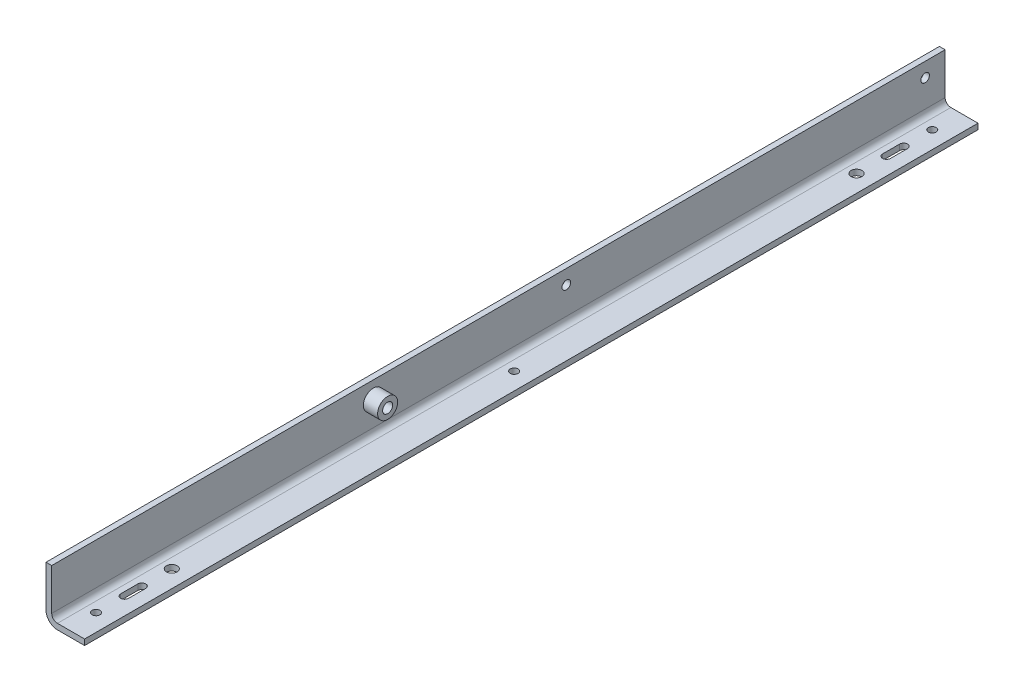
ISO-10303-21;
HEADER;
FILE_DESCRIPTION(('STEP AP214'),'2;1');
FILE_NAME('part.step','',(''),(''),'','','');
FILE_SCHEMA(('AUTOMOTIVE_DESIGN { 1 0 10303 214 1 1 1 1 }'));
ENDSEC;
DATA;
#1=APPLICATION_CONTEXT('core data for automotive mechanical design processes');
#2=APPLICATION_PROTOCOL_DEFINITION('international standard','automotive_design',2000,#1);
#3=PRODUCT_CONTEXT('',#1,'mechanical');
#4=PRODUCT('Part','Part','',(#3));
#5=PRODUCT_RELATED_PRODUCT_CATEGORY('part','',(#4));
#6=PRODUCT_DEFINITION_FORMATION('','',#4);
#7=PRODUCT_DEFINITION_CONTEXT('part definition',#1,'design');
#8=PRODUCT_DEFINITION('design','',#6,#7);
#9=PRODUCT_DEFINITION_SHAPE('','',#8);
#10=(LENGTH_UNIT() NAMED_UNIT(*) SI_UNIT(.MILLI.,.METRE.));
#11=(NAMED_UNIT(*) PLANE_ANGLE_UNIT() SI_UNIT($,.RADIAN.));
#12=(NAMED_UNIT(*) SI_UNIT($,.STERADIAN.) SOLID_ANGLE_UNIT());
#13=UNCERTAINTY_MEASURE_WITH_UNIT(LENGTH_MEASURE(1.E-05),#10,'distance_accuracy_value','');
#14=(GEOMETRIC_REPRESENTATION_CONTEXT(3) GLOBAL_UNCERTAINTY_ASSIGNED_CONTEXT((#13)) GLOBAL_UNIT_ASSIGNED_CONTEXT((#10,
#11,#12)) REPRESENTATION_CONTEXT('',''));
#15=CARTESIAN_POINT('',(0.,0.,0.));
#16=DIRECTION('',(0.,0.,1.));
#17=DIRECTION('',(1.,0.,0.));
#18=AXIS2_PLACEMENT_3D('',#15,#16,#17);
#19=CARTESIAN_POINT('',(3.99999999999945,7.99999999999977,625.));
#20=DIRECTION('',(-1.,0.,0.));
#21=DIRECTION('',(0.,0.,1.));
#22=AXIS2_PLACEMENT_3D('',#19,#20,#21);
#23=PLANE('',#22);
#24=DIRECTION('',(0.,1.,0.));
#25=VECTOR('',#24,1.);
#26=CARTESIAN_POINT('',(4.00000000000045,7.99999999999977,8.74300631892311E-13));
#27=LINE('',#26,#25);
#28=CARTESIAN_POINT('',(4.00000000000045,7.99999999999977,8.74300631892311E-13));
#29=VERTEX_POINT('',#28);
#30=CARTESIAN_POINT('',(4.00000000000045,36.9999999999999,4.30211422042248E-13));
#31=VERTEX_POINT('',#30);
#32=EDGE_CURVE('E271',#29,#31,#27,.T.);
#33=ORIENTED_EDGE('',*,*,#32,.T.);
#34=DIRECTION('',(0.,0.,-1.));
#35=VECTOR('',#34,1.);
#36=CARTESIAN_POINT('',(3.99999999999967,36.9999999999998,625.));
#37=LINE('',#36,#35);
#38=CARTESIAN_POINT('',(3.99999999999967,36.9999999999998,625.));
#39=VERTEX_POINT('',#38);
#40=EDGE_CURVE('E292',#39,#31,#37,.T.);
#41=ORIENTED_EDGE('',*,*,#40,.F.);
#42=DIRECTION('',(0.,1.,0.));
#43=VECTOR('',#42,1.);
#44=CARTESIAN_POINT('',(3.99999999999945,7.99999999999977,625.));
#45=LINE('',#44,#43);
#46=CARTESIAN_POINT('',(3.99999999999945,7.99999999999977,625.));
#47=VERTEX_POINT('',#46);
#48=EDGE_CURVE('E289',#47,#39,#45,.T.);
#49=ORIENTED_EDGE('',*,*,#48,.F.);
#50=DIRECTION('',(0.,0.,-1.));
#51=VECTOR('',#50,1.);
#52=CARTESIAN_POINT('',(3.99999999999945,7.99999999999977,625.));
#53=LINE('',#52,#51);
#54=EDGE_CURVE('E319',#47,#29,#53,.T.);
#55=ORIENTED_EDGE('',*,*,#54,.T.);
#56=EDGE_LOOP('',(#33,#41,#49,#55));
#57=FACE_BOUND('',#56,.T.);
#58=CARTESIAN_POINT('',(4.,27.,265.));
#59=DIRECTION('',(1.,0.,0.));
#60=DIRECTION('',(0.,0.,-1.));
#61=AXIS2_PLACEMENT_3D('',#58,#59,#60);
#62=CIRCLE('',#61,2.99999999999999);
#63=CARTESIAN_POINT('',(4.,27.,262.));
#64=VERTEX_POINT('',#63);
#65=EDGE_CURVE('E254',#64,#64,#62,.T.);
#66=ORIENTED_EDGE('',*,*,#65,.F.);
#67=EDGE_LOOP('',(#66));
#68=FACE_BOUND('',#67,.T.);
#69=CARTESIAN_POINT('',(4.00000000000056,26.9999999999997,14.0000000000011));
#70=DIRECTION('',(1.,0.,0.));
#71=DIRECTION('',(0.,0.,-1.));
#72=AXIS2_PLACEMENT_3D('',#69,#70,#71);
#73=CIRCLE('',#72,3.);
#74=CARTESIAN_POINT('',(4.00000000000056,26.9999999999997,11.0000000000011));
#75=VERTEX_POINT('',#74);
#76=EDGE_CURVE('E249',#75,#75,#73,.T.);
#77=ORIENTED_EDGE('',*,*,#76,.F.);
#78=EDGE_LOOP('',(#77));
#79=FACE_BOUND('',#78,.T.);
#80=CARTESIAN_POINT('',(4.00000000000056,25.,400.));
#81=DIRECTION('',(-1.,0.,0.));
#82=DIRECTION('',(0.,0.,1.));
#83=AXIS2_PLACEMENT_3D('',#80,#81,#82);
#84=CIRCLE('',#83,6.99999999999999);
#85=CARTESIAN_POINT('',(4.00000000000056,25.,407.));
#86=VERTEX_POINT('',#85);
#87=EDGE_CURVE('E347',#86,#86,#84,.F.);
#88=ORIENTED_EDGE('',*,*,#87,.F.);
#89=EDGE_LOOP('',(#88));
#90=FACE_BOUND('',#89,.T.);
#91=ADVANCED_FACE('F42',(#57,#68,#79,#90),#23,.F.);
#92=CARTESIAN_POINT('',(-3.33066907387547E-13,36.9999999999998,625.));
#93=DIRECTION('',(0.,-1.,0.));
#94=DIRECTION('',(0.,0.,-1.));
#95=AXIS2_PLACEMENT_3D('',#92,#93,#94);
#96=PLANE('',#95);
#97=DIRECTION('',(-1.,0.,0.));
#98=VECTOR('',#97,1.);
#99=CARTESIAN_POINT('',(4.44089209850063E-13,36.9999999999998,0.));
#100=LINE('',#99,#98);
#101=CARTESIAN_POINT('',(4.44089209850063E-13,36.9999999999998,0.));
#102=VERTEX_POINT('',#101);
#103=EDGE_CURVE('E262',#31,#102,#100,.T.);
#104=ORIENTED_EDGE('',*,*,#103,.T.);
#105=DIRECTION('',(0.,0.,-1.));
#106=VECTOR('',#105,1.);
#107=CARTESIAN_POINT('',(-3.33066907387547E-13,36.9999999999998,625.));
#108=LINE('',#107,#106);
#109=CARTESIAN_POINT('',(-3.33066907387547E-13,36.9999999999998,625.));
#110=VERTEX_POINT('',#109);
#111=EDGE_CURVE('E343',#110,#102,#108,.T.);
#112=ORIENTED_EDGE('',*,*,#111,.F.);
#113=DIRECTION('',(-1.,0.,0.));
#114=VECTOR('',#113,1.);
#115=CARTESIAN_POINT('',(-3.33066907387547E-13,36.9999999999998,625.));
#116=LINE('',#115,#114);
#117=EDGE_CURVE('E266',#39,#110,#116,.T.);
#118=ORIENTED_EDGE('',*,*,#117,.F.);
#119=ORIENTED_EDGE('',*,*,#40,.T.);
#120=EDGE_LOOP('',(#104,#112,#118,#119));
#121=FACE_BOUND('',#120,.T.);
#122=ADVANCED_FACE('F44',(#121),#96,.F.);
#123=CARTESIAN_POINT('',(-5.55111512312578E-13,7.99999999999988,625.000000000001));
#124=DIRECTION('',(1.,0.,0.));
#125=DIRECTION('',(0.,0.,-1.));
#126=AXIS2_PLACEMENT_3D('',#123,#124,#125);
#127=PLANE('',#126);
#128=CARTESIAN_POINT('',(7.7715611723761E-13,24.9999999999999,400.));
#129=DIRECTION('',(1.,0.,0.));
#130=DIRECTION('',(0.,0.,-1.));
#131=AXIS2_PLACEMENT_3D('',#128,#129,#130);
#132=CIRCLE('',#131,3.50000000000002);
#133=CARTESIAN_POINT('',(7.76378961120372E-13,24.9999999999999,396.5));
#134=VERTEX_POINT('',#133);
#135=EDGE_CURVE('E245',#134,#134,#132,.T.);
#136=ORIENTED_EDGE('',*,*,#135,.T.);
#137=EDGE_LOOP('',(#136));
#138=FACE_BOUND('',#137,.T.);
#139=CARTESIAN_POINT('',(9.99200722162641E-13,26.9999999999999,14.0000000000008));
#140=DIRECTION('',(1.,0.,0.));
#141=DIRECTION('',(0.,0.,-1.));
#142=AXIS2_PLACEMENT_3D('',#139,#140,#141);
#143=CIRCLE('',#142,3.);
#144=CARTESIAN_POINT('',(9.98534588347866E-13,26.9999999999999,11.0000000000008));
#145=VERTEX_POINT('',#144);
#146=EDGE_CURVE('E250',#145,#145,#143,.T.);
#147=ORIENTED_EDGE('',*,*,#146,.T.);
#148=EDGE_LOOP('',(#147));
#149=FACE_BOUND('',#148,.T.);
#150=CARTESIAN_POINT('',(6.66133814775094E-13,26.9999999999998,265.000000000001));
#151=DIRECTION('',(1.,0.,0.));
#152=DIRECTION('',(0.,0.,-1.));
#153=AXIS2_PLACEMENT_3D('',#150,#151,#152);
#154=CIRCLE('',#153,2.99999999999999);
#155=CARTESIAN_POINT('',(6.65467680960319E-13,26.9999999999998,262.000000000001));
#156=VERTEX_POINT('',#155);
#157=EDGE_CURVE('E258',#156,#156,#154,.T.);
#158=ORIENTED_EDGE('',*,*,#157,.T.);
#159=EDGE_LOOP('',(#158));
#160=FACE_BOUND('',#159,.T.);
#161=DIRECTION('',(0.,-1.,0.));
#162=VECTOR('',#161,1.);
#163=CARTESIAN_POINT('',(8.88178419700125E-13,7.99999999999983,7.63278329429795E-13));
#164=LINE('',#163,#162);
#165=CARTESIAN_POINT('',(8.88178419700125E-13,7.99999999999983,7.63278329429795E-13));
#166=VERTEX_POINT('',#165);
#167=EDGE_CURVE('E296',#102,#166,#164,.T.);
#168=ORIENTED_EDGE('',*,*,#167,.T.);
#169=DIRECTION('',(0.,0.,-1.));
#170=VECTOR('',#169,1.);
#171=CARTESIAN_POINT('',(-5.55111512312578E-13,7.99999999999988,625.000000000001));
#172=LINE('',#171,#170);
#173=CARTESIAN_POINT('',(-5.55111512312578E-13,7.99999999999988,625.000000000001));
#174=VERTEX_POINT('',#173);
#175=EDGE_CURVE('E339',#174,#166,#172,.T.);
#176=ORIENTED_EDGE('',*,*,#175,.F.);
#177=DIRECTION('',(0.,-1.,0.));
#178=VECTOR('',#177,1.);
#179=CARTESIAN_POINT('',(-5.55111512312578E-13,7.99999999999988,625.000000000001));
#180=LINE('',#179,#178);
#181=EDGE_CURVE('E270',#110,#174,#180,.T.);
#182=ORIENTED_EDGE('',*,*,#181,.F.);
#183=ORIENTED_EDGE('',*,*,#111,.T.);
#184=EDGE_LOOP('',(#168,#176,#182,#183));
#185=FACE_BOUND('',#184,.T.);
#186=ADVANCED_FACE('F425',(#138,#149,#160,#185),#127,.F.);
#187=CARTESIAN_POINT('',(7.9999999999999,8.00000000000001,625.));
#188=DIRECTION('',(0.,0.,-1.));
#189=DIRECTION('',(-1.,0.,0.));
#190=AXIS2_PLACEMENT_3D('',#187,#188,#189);
#191=CYLINDRICAL_SURFACE('',#190,8.);
#192=CARTESIAN_POINT('',(8.00000000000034,7.99999999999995,1.11022302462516E-12));
#193=DIRECTION('',(0.,0.,1.));
#194=DIRECTION('',(-1.,0.,0.));
#195=AXIS2_PLACEMENT_3D('',#192,#193,#194);
#196=CIRCLE('',#195,8.);
#197=CARTESIAN_POINT('',(8.00000000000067,0.,0.));
#198=VERTEX_POINT('',#197);
#199=EDGE_CURVE('E299',#166,#198,#196,.T.);
#200=ORIENTED_EDGE('',*,*,#199,.T.);
#201=DIRECTION('',(0.,0.,-1.));
#202=VECTOR('',#201,1.);
#203=CARTESIAN_POINT('',(7.99999999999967,-1.2490009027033E-13,625.));
#204=LINE('',#203,#202);
#205=CARTESIAN_POINT('',(7.99999999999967,-1.2490009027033E-13,625.));
#206=VERTEX_POINT('',#205);
#207=EDGE_CURVE('E335',#206,#198,#204,.T.);
#208=ORIENTED_EDGE('',*,*,#207,.F.);
#209=CARTESIAN_POINT('',(7.9999999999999,8.00000000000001,625.));
#210=DIRECTION('',(0.,0.,1.));
#211=DIRECTION('',(-1.,0.,0.));
#212=AXIS2_PLACEMENT_3D('',#209,#210,#211);
#213=CIRCLE('',#212,8.);
#214=EDGE_CURVE('E274',#174,#206,#213,.T.);
#215=ORIENTED_EDGE('',*,*,#214,.F.);
#216=ORIENTED_EDGE('',*,*,#175,.T.);
#217=EDGE_LOOP('',(#200,#208,#215,#216));
#218=FACE_BOUND('',#217,.T.);
#219=ADVANCED_FACE('F416',(#218),#191,.T.);
#220=CARTESIAN_POINT('',(7.99999999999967,-1.2490009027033E-13,625.));
#221=DIRECTION('',(0.,1.,0.));
#222=DIRECTION('',(0.,0.,1.));
#223=AXIS2_PLACEMENT_3D('',#220,#221,#222);
#224=PLANE('',#223);
#225=CARTESIAN_POINT('',(15.0000000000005,-2.35922392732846E-13,20.000000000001));
#226=DIRECTION('',(0.,-1.,0.));
#227=DIRECTION('',(0.,0.,1.));
#228=AXIS2_PLACEMENT_3D('',#225,#226,#227);
#229=CIRCLE('',#228,2.74999999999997);
#230=CARTESIAN_POINT('',(15.0000000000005,-2.35464425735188E-13,22.750000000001));
#231=VERTEX_POINT('',#230);
#232=EDGE_CURVE('E402',#231,#231,#229,.T.);
#233=ORIENTED_EDGE('',*,*,#232,.F.);
#234=EDGE_LOOP('',(#233));
#235=FACE_BOUND('',#234,.T.);
#236=CARTESIAN_POINT('',(15.0000000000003,0.,73.000000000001));
#237=DIRECTION('',(0.,-1.,0.));
#238=DIRECTION('',(0.,0.,1.));
#239=AXIS2_PLACEMENT_3D('',#236,#237,#238);
#240=CIRCLE('',#239,3.74999999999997);
#241=CARTESIAN_POINT('',(15.0000000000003,0.,76.750000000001));
#242=VERTEX_POINT('',#241);
#243=EDGE_CURVE('E386',#242,#242,#240,.T.);
#244=ORIENTED_EDGE('',*,*,#243,.F.);
#245=EDGE_LOOP('',(#244));
#246=FACE_BOUND('',#245,.T.);
#247=DIRECTION('',(0.,0.,1.));
#248=VECTOR('',#247,1.);
#249=CARTESIAN_POINT('',(17.7500000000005,0.,40.0000000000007));
#250=LINE('',#249,#248);
#251=CARTESIAN_POINT('',(17.7500000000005,0.,40.0000000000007));
#252=VERTEX_POINT('',#251);
#253=CARTESIAN_POINT('',(17.7500000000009,-1.66533453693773E-13,52.0000000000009));
#254=VERTEX_POINT('',#253);
#255=EDGE_CURVE('E171',#252,#254,#250,.T.);
#256=ORIENTED_EDGE('',*,*,#255,.F.);
#257=CARTESIAN_POINT('',(15.0000000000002,-1.52655665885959E-13,40.000000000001));
#258=DIRECTION('',(0.,-1.,0.));
#259=DIRECTION('',(0.,0.,1.));
#260=AXIS2_PLACEMENT_3D('',#257,#258,#259);
#261=CIRCLE('',#260,2.75);
#262=CARTESIAN_POINT('',(12.2500000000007,-1.66533453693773E-13,40.0000000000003));
#263=VERTEX_POINT('',#262);
#264=EDGE_CURVE('E60',#263,#252,#261,.T.);
#265=ORIENTED_EDGE('',*,*,#264,.F.);
#266=DIRECTION('',(0.,0.,-1.));
#267=VECTOR('',#266,1.);
#268=CARTESIAN_POINT('',(12.2500000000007,-1.66533453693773E-13,40.0000000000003));
#269=LINE('',#268,#267);
#270=CARTESIAN_POINT('',(12.2500000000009,-3.33066907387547E-13,52.0000000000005));
#271=VERTEX_POINT('',#270);
#272=EDGE_CURVE('E179',#271,#263,#269,.T.);
#273=ORIENTED_EDGE('',*,*,#272,.F.);
#274=CARTESIAN_POINT('',(15.0000000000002,0.,52.0000000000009));
#275=DIRECTION('',(0.,-1.,0.));
#276=DIRECTION('',(0.,0.,1.));
#277=AXIS2_PLACEMENT_3D('',#274,#275,#276);
#278=CIRCLE('',#277,2.75);
#279=EDGE_CURVE('E161',#254,#271,#278,.T.);
#280=ORIENTED_EDGE('',*,*,#279,.F.);
#281=EDGE_LOOP('',(#256,#265,#273,#280));
#282=FACE_BOUND('',#281,.T.);
#283=DIRECTION('',(0.,0.,-1.));
#284=VECTOR('',#283,1.);
#285=CARTESIAN_POINT('',(12.2499999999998,-1.11022302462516E-13,585.000000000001));
#286=LINE('',#285,#284);
#287=CARTESIAN_POINT('',(12.2499999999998,-1.11022302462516E-13,585.000000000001));
#288=VERTEX_POINT('',#287);
#289=CARTESIAN_POINT('',(12.25,0.,572.999999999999));
#290=VERTEX_POINT('',#289);
#291=EDGE_CURVE('E197',#288,#290,#286,.T.);
#292=ORIENTED_EDGE('',*,*,#291,.F.);
#293=CARTESIAN_POINT('',(14.9999999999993,-1.11022302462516E-13,585.000000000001));
#294=DIRECTION('',(0.,-1.,0.));
#295=DIRECTION('',(0.,0.,-1.));
#296=AXIS2_PLACEMENT_3D('',#293,#294,#295);
#297=CIRCLE('',#296,2.75);
#298=CARTESIAN_POINT('',(17.7499999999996,1.11022302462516E-13,585.000000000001));
#299=VERTEX_POINT('',#298);
#300=EDGE_CURVE('E190',#299,#288,#297,.T.);
#301=ORIENTED_EDGE('',*,*,#300,.F.);
#302=DIRECTION('',(0.,0.,1.));
#303=VECTOR('',#302,1.);
#304=CARTESIAN_POINT('',(17.7499999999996,1.11022302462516E-13,585.000000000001));
#305=LINE('',#304,#303);
#306=CARTESIAN_POINT('',(17.7499999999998,3.33066907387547E-13,573.));
#307=VERTEX_POINT('',#306);
#308=EDGE_CURVE('E205',#307,#299,#305,.T.);
#309=ORIENTED_EDGE('',*,*,#308,.F.);
#310=CARTESIAN_POINT('',(14.9999999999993,-1.2490009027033E-13,573.));
#311=DIRECTION('',(0.,-1.,0.));
#312=DIRECTION('',(0.,0.,-1.));
#313=AXIS2_PLACEMENT_3D('',#310,#311,#312);
#314=CIRCLE('',#313,2.75);
#315=EDGE_CURVE('E201',#290,#307,#314,.T.);
#316=ORIENTED_EDGE('',*,*,#315,.F.);
#317=EDGE_LOOP('',(#292,#301,#309,#316));
#318=FACE_BOUND('',#317,.T.);
#319=CARTESIAN_POINT('',(15.0000000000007,0.,312.500000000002));
#320=DIRECTION('',(0.,-1.,0.));
#321=DIRECTION('',(0.,0.,-1.));
#322=AXIS2_PLACEMENT_3D('',#319,#320,#321);
#323=CIRCLE('',#322,2.75);
#324=CARTESIAN_POINT('',(15.0000000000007,0.,309.750000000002));
#325=VERTEX_POINT('',#324);
#326=EDGE_CURVE('E213',#325,#325,#323,.T.);
#327=ORIENTED_EDGE('',*,*,#326,.F.);
#328=EDGE_LOOP('',(#327));
#329=FACE_BOUND('',#328,.T.);
#330=CARTESIAN_POINT('',(14.9999999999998,-4.30211422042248E-13,552.000000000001));
#331=DIRECTION('',(0.,-1.,0.));
#332=DIRECTION('',(0.,0.,-1.));
#333=AXIS2_PLACEMENT_3D('',#330,#331,#332);
#334=CIRCLE('',#333,3.74999999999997);
#335=CARTESIAN_POINT('',(14.9999999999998,-4.308359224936E-13,548.250000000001));
#336=VERTEX_POINT('',#335);
#337=EDGE_CURVE('E227',#336,#336,#334,.T.);
#338=ORIENTED_EDGE('',*,*,#337,.F.);
#339=EDGE_LOOP('',(#338));
#340=FACE_BOUND('',#339,.T.);
#341=CARTESIAN_POINT('',(14.9999999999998,0.,605.000000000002));
#342=DIRECTION('',(0.,-1.,0.));
#343=DIRECTION('',(0.,0.,-1.));
#344=AXIS2_PLACEMENT_3D('',#341,#342,#343);
#345=CIRCLE('',#344,2.74999999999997);
#346=CARTESIAN_POINT('',(14.9999999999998,0.,602.250000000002));
#347=VERTEX_POINT('',#346);
#348=EDGE_CURVE('E232',#347,#347,#345,.T.);
#349=ORIENTED_EDGE('',*,*,#348,.F.);
#350=EDGE_LOOP('',(#349));
#351=FACE_BOUND('',#350,.T.);
#352=DIRECTION('',(1.,0.,0.));
#353=VECTOR('',#352,1.);
#354=CARTESIAN_POINT('',(8.00000000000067,0.,0.));
#355=LINE('',#354,#353);
#356=CARTESIAN_POINT('',(27.0000000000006,-1.2490009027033E-13,9.99200722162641E-13));
#357=VERTEX_POINT('',#356);
#358=EDGE_CURVE('E302',#198,#357,#355,.T.);
#359=ORIENTED_EDGE('',*,*,#358,.T.);
#360=DIRECTION('',(0.,0.,-1.));
#361=VECTOR('',#360,1.);
#362=CARTESIAN_POINT('',(26.9999999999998,-2.35922392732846E-13,625.));
#363=LINE('',#362,#361);
#364=CARTESIAN_POINT('',(26.9999999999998,-2.35922392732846E-13,625.));
#365=VERTEX_POINT('',#364);
#366=EDGE_CURVE('E331',#365,#357,#363,.T.);
#367=ORIENTED_EDGE('',*,*,#366,.F.);
#368=DIRECTION('',(1.,0.,0.));
#369=VECTOR('',#368,1.);
#370=CARTESIAN_POINT('',(7.99999999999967,-1.2490009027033E-13,625.));
#371=LINE('',#370,#369);
#372=EDGE_CURVE('E277',#206,#365,#371,.T.);
#373=ORIENTED_EDGE('',*,*,#372,.F.);
#374=ORIENTED_EDGE('',*,*,#207,.T.);
#375=EDGE_LOOP('',(#359,#367,#373,#374));
#376=FACE_BOUND('',#375,.T.);
#377=ADVANCED_FACE('F176',(#235,#246,#282,#318,#329,#340,#351,#376),#224,.F.);
#378=CARTESIAN_POINT('',(27.0000000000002,3.99999999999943,625.000000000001));
#379=DIRECTION('',(-1.,0.,0.));
#380=DIRECTION('',(0.,0.,1.));
#381=AXIS2_PLACEMENT_3D('',#378,#379,#380);
#382=PLANE('',#381);
#383=DIRECTION('',(0.,1.,0.));
#384=VECTOR('',#383,1.);
#385=CARTESIAN_POINT('',(27.0000000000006,3.99999999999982,0.));
#386=LINE('',#385,#384);
#387=CARTESIAN_POINT('',(27.0000000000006,3.99999999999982,0.));
#388=VERTEX_POINT('',#387);
#389=EDGE_CURVE('E305',#357,#388,#386,.T.);
#390=ORIENTED_EDGE('',*,*,#389,.T.);
#391=DIRECTION('',(0.,0.,-1.));
#392=VECTOR('',#391,1.);
#393=CARTESIAN_POINT('',(27.0000000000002,3.99999999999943,625.000000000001));
#394=LINE('',#393,#392);
#395=CARTESIAN_POINT('',(27.0000000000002,3.99999999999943,625.000000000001));
#396=VERTEX_POINT('',#395);
#397=EDGE_CURVE('E327',#396,#388,#394,.T.);
#398=ORIENTED_EDGE('',*,*,#397,.F.);
#399=DIRECTION('',(0.,1.,0.));
#400=VECTOR('',#399,1.);
#401=CARTESIAN_POINT('',(27.0000000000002,3.99999999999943,625.000000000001));
#402=LINE('',#401,#400);
#403=EDGE_CURVE('E280',#365,#396,#402,.T.);
#404=ORIENTED_EDGE('',*,*,#403,.F.);
#405=ORIENTED_EDGE('',*,*,#366,.T.);
#406=EDGE_LOOP('',(#390,#398,#404,#405));
#407=FACE_BOUND('',#406,.T.);
#408=ADVANCED_FACE('F415',(#407),#382,.F.);
#409=CARTESIAN_POINT('',(7.99999999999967,3.99999999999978,625.000000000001));
#410=DIRECTION('',(0.,-1.,0.));
#411=DIRECTION('',(0.,0.,-1.));
#412=AXIS2_PLACEMENT_3D('',#409,#410,#411);
#413=PLANE('',#412);
#414=CARTESIAN_POINT('',(15.0000000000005,4.,20.000000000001));
#415=DIRECTION('',(0.,-1.,0.));
#416=DIRECTION('',(0.,0.,-1.));
#417=AXIS2_PLACEMENT_3D('',#414,#415,#416);
#418=CIRCLE('',#417,2.74999999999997);
#419=CARTESIAN_POINT('',(15.0000000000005,4.,17.250000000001));
#420=VERTEX_POINT('',#419);
#421=EDGE_CURVE('E46',#420,#420,#418,.T.);
#422=ORIENTED_EDGE('',*,*,#421,.T.);
#423=EDGE_LOOP('',(#422));
#424=FACE_BOUND('',#423,.T.);
#425=CARTESIAN_POINT('',(15.0000000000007,3.99999999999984,73.0000000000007));
#426=DIRECTION('',(0.,-1.,0.));
#427=DIRECTION('',(0.,0.,-1.));
#428=AXIS2_PLACEMENT_3D('',#425,#426,#427);
#429=CIRCLE('',#428,3.74999999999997);
#430=CARTESIAN_POINT('',(15.0000000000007,3.99999999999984,69.2500000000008));
#431=VERTEX_POINT('',#430);
#432=EDGE_CURVE('E383',#431,#431,#429,.T.);
#433=ORIENTED_EDGE('',*,*,#432,.T.);
#434=EDGE_LOOP('',(#433));
#435=FACE_BOUND('',#434,.T.);
#436=DIRECTION('',(0.,0.,-1.));
#437=VECTOR('',#436,1.);
#438=CARTESIAN_POINT('',(12.2499999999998,3.99999999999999,625.));
#439=LINE('',#438,#437);
#440=CARTESIAN_POINT('',(12.2500000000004,3.99999999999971,52.0000000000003));
#441=VERTEX_POINT('',#440);
#442=CARTESIAN_POINT('',(12.2500000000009,3.99999999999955,40.0000000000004));
#443=VERTEX_POINT('',#442);
#444=EDGE_CURVE('E52',#441,#443,#439,.T.);
#445=ORIENTED_EDGE('',*,*,#444,.T.);
#446=CARTESIAN_POINT('',(15.0000000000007,3.99999999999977,40.0000000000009));
#447=DIRECTION('',(0.,-1.,0.));
#448=DIRECTION('',(0.,0.,-1.));
#449=AXIS2_PLACEMENT_3D('',#446,#447,#448);
#450=CIRCLE('',#449,2.75);
#451=CARTESIAN_POINT('',(17.7500000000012,3.99999999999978,40.0000000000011));
#452=VERTEX_POINT('',#451);
#453=EDGE_CURVE('E11',#443,#452,#450,.T.);
#454=ORIENTED_EDGE('',*,*,#453,.T.);
#455=DIRECTION('',(0.,0.,1.));
#456=VECTOR('',#455,1.);
#457=CARTESIAN_POINT('',(17.7499999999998,3.99999999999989,625.000000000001));
#458=LINE('',#457,#456);
#459=CARTESIAN_POINT('',(17.7500000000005,3.99999999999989,52.0000000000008));
#460=VERTEX_POINT('',#459);
#461=EDGE_CURVE('E376',#452,#460,#458,.T.);
#462=ORIENTED_EDGE('',*,*,#461,.T.);
#463=CARTESIAN_POINT('',(15.0000000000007,3.99999999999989,52.0000000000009));
#464=DIRECTION('',(0.,-1.,0.));
#465=DIRECTION('',(0.,0.,-1.));
#466=AXIS2_PLACEMENT_3D('',#463,#464,#465);
#467=CIRCLE('',#466,2.75);
#468=EDGE_CURVE('E164',#460,#441,#467,.T.);
#469=ORIENTED_EDGE('',*,*,#468,.T.);
#470=EDGE_LOOP('',(#445,#454,#462,#469));
#471=FACE_BOUND('',#470,.T.);
#472=DIRECTION('',(0.,0.,1.));
#473=VECTOR('',#472,1.);
#474=CARTESIAN_POINT('',(17.7499999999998,4.,625.000000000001));
#475=LINE('',#474,#473);
#476=CARTESIAN_POINT('',(17.7499999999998,4.00000000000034,573.));
#477=VERTEX_POINT('',#476);
#478=CARTESIAN_POINT('',(17.7499999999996,4.,585.000000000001));
#479=VERTEX_POINT('',#478);
#480=EDGE_CURVE('E368',#477,#479,#475,.T.);
#481=ORIENTED_EDGE('',*,*,#480,.T.);
#482=CARTESIAN_POINT('',(14.9999999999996,4.00000000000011,585.000000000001));
#483=DIRECTION('',(0.,-1.,0.));
#484=DIRECTION('',(0.,0.,-1.));
#485=AXIS2_PLACEMENT_3D('',#482,#483,#484);
#486=CIRCLE('',#485,2.75);
#487=CARTESIAN_POINT('',(12.2499999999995,3.99999999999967,585.));
#488=VERTEX_POINT('',#487);
#489=EDGE_CURVE('E372',#479,#488,#486,.T.);
#490=ORIENTED_EDGE('',*,*,#489,.T.);
#491=DIRECTION('',(0.,0.,-1.));
#492=VECTOR('',#491,1.);
#493=CARTESIAN_POINT('',(12.2499999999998,3.99999999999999,625.));
#494=LINE('',#493,#492);
#495=CARTESIAN_POINT('',(12.25,4.,573.));
#496=VERTEX_POINT('',#495);
#497=EDGE_CURVE('E351',#488,#496,#494,.T.);
#498=ORIENTED_EDGE('',*,*,#497,.T.);
#499=CARTESIAN_POINT('',(14.9999999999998,4.00000000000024,573.));
#500=DIRECTION('',(0.,-1.,0.));
#501=DIRECTION('',(0.,0.,-1.));
#502=AXIS2_PLACEMENT_3D('',#499,#500,#501);
#503=CIRCLE('',#502,2.75);
#504=EDGE_CURVE('E364',#496,#477,#503,.T.);
#505=ORIENTED_EDGE('',*,*,#504,.T.);
#506=EDGE_LOOP('',(#481,#490,#498,#505));
#507=FACE_BOUND('',#506,.T.);
#508=CARTESIAN_POINT('',(15.0000000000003,4.,312.500000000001));
#509=DIRECTION('',(0.,-1.,0.));
#510=DIRECTION('',(0.,0.,-1.));
#511=AXIS2_PLACEMENT_3D('',#508,#509,#510);
#512=CIRCLE('',#511,2.75);
#513=CARTESIAN_POINT('',(15.0000000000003,4.,309.750000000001));
#514=VERTEX_POINT('',#513);
#515=EDGE_CURVE('E226',#514,#514,#512,.T.);
#516=ORIENTED_EDGE('',*,*,#515,.T.);
#517=EDGE_LOOP('',(#516));
#518=FACE_BOUND('',#517,.T.);
#519=CARTESIAN_POINT('',(14.9999999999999,3.99999999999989,552.000000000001));
#520=DIRECTION('',(0.,-1.,0.));
#521=DIRECTION('',(0.,0.,-1.));
#522=AXIS2_PLACEMENT_3D('',#519,#520,#521);
#523=CIRCLE('',#522,3.74999999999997);
#524=CARTESIAN_POINT('',(14.9999999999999,3.99999999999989,548.250000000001));
#525=VERTEX_POINT('',#524);
#526=EDGE_CURVE('E231',#525,#525,#523,.T.);
#527=ORIENTED_EDGE('',*,*,#526,.T.);
#528=EDGE_LOOP('',(#527));
#529=FACE_BOUND('',#528,.T.);
#530=CARTESIAN_POINT('',(15.,3.99999999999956,605.000000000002));
#531=DIRECTION('',(0.,-1.,0.));
#532=DIRECTION('',(0.,0.,-1.));
#533=AXIS2_PLACEMENT_3D('',#530,#531,#532);
#534=CIRCLE('',#533,2.74999999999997);
#535=CARTESIAN_POINT('',(15.,3.99999999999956,602.250000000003));
#536=VERTEX_POINT('',#535);
#537=EDGE_CURVE('E236',#536,#536,#534,.T.);
#538=ORIENTED_EDGE('',*,*,#537,.T.);
#539=EDGE_LOOP('',(#538));
#540=FACE_BOUND('',#539,.T.);
#541=DIRECTION('',(-1.,0.,0.));
#542=VECTOR('',#541,1.);
#543=CARTESIAN_POINT('',(8.00000000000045,3.99999999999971,2.35922392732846E-13));
#544=LINE('',#543,#542);
#545=CARTESIAN_POINT('',(8.00000000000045,3.99999999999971,2.35922392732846E-13));
#546=VERTEX_POINT('',#545);
#547=EDGE_CURVE('E308',#388,#546,#544,.T.);
#548=ORIENTED_EDGE('',*,*,#547,.T.);
#549=DIRECTION('',(0.,0.,-1.));
#550=VECTOR('',#549,1.);
#551=CARTESIAN_POINT('',(7.99999999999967,3.99999999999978,625.000000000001));
#552=LINE('',#551,#550);
#553=CARTESIAN_POINT('',(7.99999999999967,3.99999999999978,625.000000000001));
#554=VERTEX_POINT('',#553);
#555=EDGE_CURVE('E323',#554,#546,#552,.T.);
#556=ORIENTED_EDGE('',*,*,#555,.F.);
#557=DIRECTION('',(-1.,0.,0.));
#558=VECTOR('',#557,1.);
#559=CARTESIAN_POINT('',(7.99999999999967,3.99999999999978,625.000000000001));
#560=LINE('',#559,#558);
#561=EDGE_CURVE('E283',#396,#554,#560,.T.);
#562=ORIENTED_EDGE('',*,*,#561,.F.);
#563=ORIENTED_EDGE('',*,*,#397,.T.);
#564=EDGE_LOOP('',(#548,#556,#562,#563));
#565=FACE_BOUND('',#564,.T.);
#566=ADVANCED_FACE('F422',(#424,#435,#471,#507,#518,#529,#540,#565),#413,.F.);
#567=CARTESIAN_POINT('',(7.9999999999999,8.00000000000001,625.));
#568=DIRECTION('',(0.,0.,-1.));
#569=DIRECTION('',(-1.,0.,0.));
#570=AXIS2_PLACEMENT_3D('',#567,#568,#569);
#571=CYLINDRICAL_SURFACE('',#570,4.);
#572=CARTESIAN_POINT('',(8.00000000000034,7.99999999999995,1.11022302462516E-12));
#573=DIRECTION('',(0.,0.,-1.));
#574=DIRECTION('',(1.,0.,0.));
#575=AXIS2_PLACEMENT_3D('',#572,#573,#574);
#576=CIRCLE('',#575,4.);
#577=EDGE_CURVE('E311',#546,#29,#576,.T.);
#578=ORIENTED_EDGE('',*,*,#577,.T.);
#579=ORIENTED_EDGE('',*,*,#54,.F.);
#580=CARTESIAN_POINT('',(7.9999999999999,8.00000000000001,625.));
#581=DIRECTION('',(0.,0.,-1.));
#582=DIRECTION('',(1.,0.,0.));
#583=AXIS2_PLACEMENT_3D('',#580,#581,#582);
#584=CIRCLE('',#583,4.);
#585=EDGE_CURVE('E286',#554,#47,#584,.T.);
#586=ORIENTED_EDGE('',*,*,#585,.F.);
#587=ORIENTED_EDGE('',*,*,#555,.T.);
#588=EDGE_LOOP('',(#578,#579,#586,#587));
#589=FACE_BOUND('',#588,.T.);
#590=ADVANCED_FACE('F440',(#589),#571,.F.);
#591=CARTESIAN_POINT('',(7.9999999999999,8.00000000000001,625.));
#592=DIRECTION('',(0.,0.,1.));
#593=DIRECTION('',(1.,0.,0.));
#594=AXIS2_PLACEMENT_3D('',#591,#592,#593);
#595=PLANE('',#594);
#596=ORIENTED_EDGE('',*,*,#117,.T.);
#597=ORIENTED_EDGE('',*,*,#181,.T.);
#598=ORIENTED_EDGE('',*,*,#214,.T.);
#599=ORIENTED_EDGE('',*,*,#372,.T.);
#600=ORIENTED_EDGE('',*,*,#403,.T.);
#601=ORIENTED_EDGE('',*,*,#561,.T.);
#602=ORIENTED_EDGE('',*,*,#585,.T.);
#603=ORIENTED_EDGE('',*,*,#48,.T.);
#604=EDGE_LOOP('',(#596,#597,#598,#599,#600,#601,#602,#603));
#605=FACE_BOUND('',#604,.T.);
#606=ADVANCED_FACE('F443',(#605),#595,.T.);
#607=CARTESIAN_POINT('',(8.00000000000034,7.99999999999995,1.11022302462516E-12));
#608=DIRECTION('',(0.,0.,1.));
#609=DIRECTION('',(1.,0.,0.));
#610=AXIS2_PLACEMENT_3D('',#607,#608,#609);
#611=PLANE('',#610);
#612=ORIENTED_EDGE('',*,*,#103,.F.);
#613=ORIENTED_EDGE('',*,*,#32,.F.);
#614=ORIENTED_EDGE('',*,*,#577,.F.);
#615=ORIENTED_EDGE('',*,*,#547,.F.);
#616=ORIENTED_EDGE('',*,*,#389,.F.);
#617=ORIENTED_EDGE('',*,*,#358,.F.);
#618=ORIENTED_EDGE('',*,*,#199,.F.);
#619=ORIENTED_EDGE('',*,*,#167,.F.);
#620=EDGE_LOOP('',(#612,#613,#614,#615,#616,#617,#618,#619));
#621=FACE_BOUND('',#620,.T.);
#622=ADVANCED_FACE('F438',(#621),#611,.F.);
#623=CARTESIAN_POINT('',(6.66133814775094E-13,26.9999999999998,265.000000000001));
#624=DIRECTION('',(1.,0.,0.));
#625=DIRECTION('',(0.,0.,-1.));
#626=AXIS2_PLACEMENT_3D('',#623,#624,#625);
#627=CYLINDRICAL_SURFACE('',#626,2.99999999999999);
#628=ORIENTED_EDGE('',*,*,#157,.F.);
#629=EDGE_LOOP('',(#628));
#630=FACE_BOUND('',#629,.T.);
#631=ORIENTED_EDGE('',*,*,#65,.T.);
#632=EDGE_LOOP('',(#631));
#633=FACE_BOUND('',#632,.T.);
#634=ADVANCED_FACE('F495',(#630,#633),#627,.F.);
#635=CARTESIAN_POINT('',(9.99200722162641E-13,26.9999999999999,14.0000000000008));
#636=DIRECTION('',(1.,0.,0.));
#637=DIRECTION('',(0.,0.,-1.));
#638=AXIS2_PLACEMENT_3D('',#635,#636,#637);
#639=CYLINDRICAL_SURFACE('',#638,3.);
#640=ORIENTED_EDGE('',*,*,#146,.F.);
#641=EDGE_LOOP('',(#640));
#642=FACE_BOUND('',#641,.T.);
#643=ORIENTED_EDGE('',*,*,#76,.T.);
#644=EDGE_LOOP('',(#643));
#645=FACE_BOUND('',#644,.T.);
#646=ADVANCED_FACE('F498',(#642,#645),#639,.F.);
#647=CARTESIAN_POINT('',(7.7715611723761E-13,24.9999999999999,400.));
#648=DIRECTION('',(1.,0.,0.));
#649=DIRECTION('',(0.,0.,-1.));
#650=AXIS2_PLACEMENT_3D('',#647,#648,#649);
#651=CYLINDRICAL_SURFACE('',#650,3.50000000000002);
#652=ORIENTED_EDGE('',*,*,#135,.F.);
#653=EDGE_LOOP('',(#652));
#654=FACE_BOUND('',#653,.T.);
#655=CARTESIAN_POINT('',(14.0000000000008,24.9999999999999,400.000000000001));
#656=DIRECTION('',(1.,0.,0.));
#657=DIRECTION('',(0.,0.,-1.));
#658=AXIS2_PLACEMENT_3D('',#655,#656,#657);
#659=CIRCLE('',#658,3.50000000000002);
#660=CARTESIAN_POINT('',(14.0000000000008,24.9999999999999,396.500000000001));
#661=VERTEX_POINT('',#660);
#662=EDGE_CURVE('E237',#661,#661,#659,.T.);
#663=ORIENTED_EDGE('',*,*,#662,.T.);
#664=EDGE_LOOP('',(#663));
#665=FACE_BOUND('',#664,.T.);
#666=ADVANCED_FACE('F519',(#654,#665),#651,.F.);
#667=CARTESIAN_POINT('',(14.0000000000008,24.9999999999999,400.000000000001));
#668=DIRECTION('',(1.,0.,0.));
#669=DIRECTION('',(0.,0.,-1.));
#670=AXIS2_PLACEMENT_3D('',#667,#668,#669);
#671=PLANE('',#670);
#672=CARTESIAN_POINT('',(14.0000000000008,24.9999999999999,400.000000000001));
#673=DIRECTION('',(1.,0.,0.));
#674=DIRECTION('',(0.,0.,-1.));
#675=AXIS2_PLACEMENT_3D('',#672,#673,#674);
#676=CIRCLE('',#675,6.99999999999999);
#677=CARTESIAN_POINT('',(14.0000000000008,24.9999999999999,393.000000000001));
#678=VERTEX_POINT('',#677);
#679=EDGE_CURVE('E241',#678,#678,#676,.T.);
#680=ORIENTED_EDGE('',*,*,#679,.T.);
#681=EDGE_LOOP('',(#680));
#682=FACE_BOUND('',#681,.T.);
#683=ORIENTED_EDGE('',*,*,#662,.F.);
#684=EDGE_LOOP('',(#683));
#685=FACE_BOUND('',#684,.T.);
#686=ADVANCED_FACE('F509',(#682,#685),#671,.T.);
#687=CARTESIAN_POINT('',(14.0000000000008,24.9999999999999,400.000000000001));
#688=DIRECTION('',(-1.,0.,0.));
#689=DIRECTION('',(0.,0.,1.));
#690=AXIS2_PLACEMENT_3D('',#687,#688,#689);
#691=CYLINDRICAL_SURFACE('',#690,6.99999999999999);
#692=ORIENTED_EDGE('',*,*,#679,.F.);
#693=EDGE_LOOP('',(#692));
#694=FACE_BOUND('',#693,.T.);
#695=ORIENTED_EDGE('',*,*,#87,.T.);
#696=EDGE_LOOP('',(#695));
#697=FACE_BOUND('',#696,.T.);
#698=ADVANCED_FACE('F506',(#694,#697),#691,.T.);
#699=CARTESIAN_POINT('',(14.9999999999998,37.,605.000000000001));
#700=DIRECTION('',(0.,-1.,0.));
#701=DIRECTION('',(0.,0.,-1.));
#702=AXIS2_PLACEMENT_3D('',#699,#700,#701);
#703=CYLINDRICAL_SURFACE('',#702,2.74999999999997);
#704=ORIENTED_EDGE('',*,*,#348,.T.);
#705=EDGE_LOOP('',(#704));
#706=FACE_BOUND('',#705,.T.);
#707=ORIENTED_EDGE('',*,*,#537,.F.);
#708=EDGE_LOOP('',(#707));
#709=FACE_BOUND('',#708,.T.);
#710=ADVANCED_FACE('F508',(#706,#709),#703,.F.);
#711=CARTESIAN_POINT('',(14.9999999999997,36.9999999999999,552.000000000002));
#712=DIRECTION('',(0.,-1.,0.));
#713=DIRECTION('',(0.,0.,-1.));
#714=AXIS2_PLACEMENT_3D('',#711,#712,#713);
#715=CYLINDRICAL_SURFACE('',#714,3.74999999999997);
#716=ORIENTED_EDGE('',*,*,#337,.T.);
#717=EDGE_LOOP('',(#716));
#718=FACE_BOUND('',#717,.T.);
#719=ORIENTED_EDGE('',*,*,#526,.F.);
#720=EDGE_LOOP('',(#719));
#721=FACE_BOUND('',#720,.T.);
#722=ADVANCED_FACE('F516',(#718,#721),#715,.F.);
#723=CARTESIAN_POINT('',(15.0000000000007,36.9999999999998,312.500000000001));
#724=DIRECTION('',(0.,-1.,0.));
#725=DIRECTION('',(0.,0.,-1.));
#726=AXIS2_PLACEMENT_3D('',#723,#724,#725);
#727=CYLINDRICAL_SURFACE('',#726,2.75);
#728=ORIENTED_EDGE('',*,*,#326,.T.);
#729=EDGE_LOOP('',(#728));
#730=FACE_BOUND('',#729,.T.);
#731=ORIENTED_EDGE('',*,*,#515,.F.);
#732=EDGE_LOOP('',(#731));
#733=FACE_BOUND('',#732,.T.);
#734=ADVANCED_FACE('F574',(#730,#733),#727,.F.);
#735=CARTESIAN_POINT('',(15.,37.0000000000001,585.000000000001));
#736=DIRECTION('',(0.,-1.,0.));
#737=DIRECTION('',(0.,0.,-1.));
#738=AXIS2_PLACEMENT_3D('',#735,#736,#737);
#739=CYLINDRICAL_SURFACE('',#738,2.75);
#740=DIRECTION('',(0.,-1.,0.));
#741=VECTOR('',#740,1.);
#742=CARTESIAN_POINT('',(17.7499999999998,37.0000000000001,585.000000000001));
#743=LINE('',#742,#741);
#744=EDGE_CURVE('E210',#479,#299,#743,.T.);
#745=ORIENTED_EDGE('',*,*,#744,.T.);
#746=ORIENTED_EDGE('',*,*,#300,.T.);
#747=DIRECTION('',(0.,-1.,0.));
#748=VECTOR('',#747,1.);
#749=CARTESIAN_POINT('',(12.2499999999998,36.9999999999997,585.000000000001));
#750=LINE('',#749,#748);
#751=EDGE_CURVE('E209',#488,#288,#750,.T.);
#752=ORIENTED_EDGE('',*,*,#751,.F.);
#753=ORIENTED_EDGE('',*,*,#489,.F.);
#754=EDGE_LOOP('',(#745,#746,#752,#753));
#755=FACE_BOUND('',#754,.T.);
#756=ADVANCED_FACE('F584',(#755),#739,.F.);
#757=CARTESIAN_POINT('',(17.7499999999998,37.0000000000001,585.000000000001));
#758=DIRECTION('',(1.,0.,0.));
#759=DIRECTION('',(0.,0.,-1.));
#760=AXIS2_PLACEMENT_3D('',#757,#758,#759);
#761=PLANE('',#760);
#762=DIRECTION('',(0.,-1.,0.));
#763=VECTOR('',#762,1.);
#764=CARTESIAN_POINT('',(17.7499999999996,37.,573.000000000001));
#765=LINE('',#764,#763);
#766=EDGE_CURVE('E214',#477,#307,#765,.T.);
#767=ORIENTED_EDGE('',*,*,#766,.T.);
#768=ORIENTED_EDGE('',*,*,#308,.T.);
#769=ORIENTED_EDGE('',*,*,#744,.F.);
#770=ORIENTED_EDGE('',*,*,#480,.F.);
#771=EDGE_LOOP('',(#767,#768,#769,#770));
#772=FACE_BOUND('',#771,.T.);
#773=ADVANCED_FACE('F594',(#772),#761,.F.);
#774=CARTESIAN_POINT('',(14.9999999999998,36.9999999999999,573.000000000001));
#775=DIRECTION('',(0.,-1.,0.));
#776=DIRECTION('',(0.,0.,-1.));
#777=AXIS2_PLACEMENT_3D('',#774,#775,#776);
#778=CYLINDRICAL_SURFACE('',#777,2.75);
#779=DIRECTION('',(0.,-1.,0.));
#780=VECTOR('',#779,1.);
#781=CARTESIAN_POINT('',(12.25,36.9999999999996,573.));
#782=LINE('',#781,#780);
#783=EDGE_CURVE('E217',#496,#290,#782,.T.);
#784=ORIENTED_EDGE('',*,*,#783,.T.);
#785=ORIENTED_EDGE('',*,*,#315,.T.);
#786=ORIENTED_EDGE('',*,*,#766,.F.);
#787=ORIENTED_EDGE('',*,*,#504,.F.);
#788=EDGE_LOOP('',(#784,#785,#786,#787));
#789=FACE_BOUND('',#788,.T.);
#790=ADVANCED_FACE('F604',(#789),#778,.F.);
#791=CARTESIAN_POINT('',(12.2499999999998,36.9999999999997,585.000000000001));
#792=DIRECTION('',(-1.,0.,0.));
#793=DIRECTION('',(0.,0.,1.));
#794=AXIS2_PLACEMENT_3D('',#791,#792,#793);
#795=PLANE('',#794);
#796=ORIENTED_EDGE('',*,*,#751,.T.);
#797=ORIENTED_EDGE('',*,*,#291,.T.);
#798=ORIENTED_EDGE('',*,*,#783,.F.);
#799=ORIENTED_EDGE('',*,*,#497,.F.);
#800=EDGE_LOOP('',(#796,#797,#798,#799));
#801=FACE_BOUND('',#800,.T.);
#802=ADVANCED_FACE('F614',(#801),#795,.F.);
#803=CARTESIAN_POINT('',(15.0000000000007,36.9999999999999,40.0000000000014));
#804=DIRECTION('',(0.,-1.,0.));
#805=DIRECTION('',(0.,0.,-1.));
#806=AXIS2_PLACEMENT_3D('',#803,#804,#805);
#807=CYLINDRICAL_SURFACE('',#806,2.75);
#808=DIRECTION('',(0.,-1.,0.));
#809=VECTOR('',#808,1.);
#810=CARTESIAN_POINT('',(12.2500000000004,36.9999999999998,40.0000000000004));
#811=LINE('',#810,#809);
#812=EDGE_CURVE('E187',#443,#263,#811,.T.);
#813=ORIENTED_EDGE('',*,*,#812,.T.);
#814=ORIENTED_EDGE('',*,*,#264,.T.);
#815=DIRECTION('',(0.,-1.,0.));
#816=VECTOR('',#815,1.);
#817=CARTESIAN_POINT('',(17.7500000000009,36.9999999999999,40.000000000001));
#818=LINE('',#817,#816);
#819=EDGE_CURVE('E168',#452,#252,#818,.T.);
#820=ORIENTED_EDGE('',*,*,#819,.F.);
#821=ORIENTED_EDGE('',*,*,#453,.F.);
#822=EDGE_LOOP('',(#813,#814,#820,#821));
#823=FACE_BOUND('',#822,.T.);
#824=ADVANCED_FACE('F624',(#823),#807,.F.);
#825=CARTESIAN_POINT('',(12.2500000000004,36.9999999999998,40.0000000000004));
#826=DIRECTION('',(-1.,0.,0.));
#827=DIRECTION('',(0.,0.,1.));
#828=AXIS2_PLACEMENT_3D('',#825,#826,#827);
#829=PLANE('',#828);
#830=DIRECTION('',(0.,-1.,0.));
#831=VECTOR('',#830,1.);
#832=CARTESIAN_POINT('',(12.2500000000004,36.9999999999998,52.0000000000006));
#833=LINE('',#832,#831);
#834=EDGE_CURVE('E167',#441,#271,#833,.T.);
#835=ORIENTED_EDGE('',*,*,#834,.T.);
#836=ORIENTED_EDGE('',*,*,#272,.T.);
#837=ORIENTED_EDGE('',*,*,#812,.F.);
#838=ORIENTED_EDGE('',*,*,#444,.F.);
#839=EDGE_LOOP('',(#835,#836,#837,#838));
#840=FACE_BOUND('',#839,.T.);
#841=ADVANCED_FACE('F634',(#840),#829,.F.);
#842=CARTESIAN_POINT('',(15.0000000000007,36.9999999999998,52.000000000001));
#843=DIRECTION('',(0.,-1.,0.));
#844=DIRECTION('',(0.,0.,-1.));
#845=AXIS2_PLACEMENT_3D('',#842,#843,#844);
#846=CYLINDRICAL_SURFACE('',#845,2.75);
#847=DIRECTION('',(0.,-1.,0.));
#848=VECTOR('',#847,1.);
#849=CARTESIAN_POINT('',(17.7500000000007,37.0000000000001,52.0000000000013));
#850=LINE('',#849,#848);
#851=EDGE_CURVE('E68',#460,#254,#850,.T.);
#852=ORIENTED_EDGE('',*,*,#851,.T.);
#853=ORIENTED_EDGE('',*,*,#279,.T.);
#854=ORIENTED_EDGE('',*,*,#834,.F.);
#855=ORIENTED_EDGE('',*,*,#468,.F.);
#856=EDGE_LOOP('',(#852,#853,#854,#855));
#857=FACE_BOUND('',#856,.T.);
#858=ADVANCED_FACE('F158',(#857),#846,.F.);
#859=CARTESIAN_POINT('',(17.7500000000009,36.9999999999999,40.000000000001));
#860=DIRECTION('',(1.,0.,0.));
#861=DIRECTION('',(0.,0.,-1.));
#862=AXIS2_PLACEMENT_3D('',#859,#860,#861);
#863=PLANE('',#862);
#864=ORIENTED_EDGE('',*,*,#819,.T.);
#865=ORIENTED_EDGE('',*,*,#255,.T.);
#866=ORIENTED_EDGE('',*,*,#851,.F.);
#867=ORIENTED_EDGE('',*,*,#461,.F.);
#868=EDGE_LOOP('',(#864,#865,#866,#867));
#869=FACE_BOUND('',#868,.T.);
#870=ADVANCED_FACE('F172',(#869),#863,.F.);
#871=CARTESIAN_POINT('',(15.0000000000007,36.9999999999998,73.0000000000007));
#872=DIRECTION('',(0.,-1.,0.));
#873=DIRECTION('',(0.,0.,-1.));
#874=AXIS2_PLACEMENT_3D('',#871,#872,#873);
#875=CYLINDRICAL_SURFACE('',#874,3.74999999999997);
#876=ORIENTED_EDGE('',*,*,#243,.T.);
#877=EDGE_LOOP('',(#876));
#878=FACE_BOUND('',#877,.T.);
#879=ORIENTED_EDGE('',*,*,#432,.F.);
#880=EDGE_LOOP('',(#879));
#881=FACE_BOUND('',#880,.T.);
#882=ADVANCED_FACE('F660',(#878,#881),#875,.F.);
#883=CARTESIAN_POINT('',(15.0000000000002,36.9999999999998,20.0000000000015));
#884=DIRECTION('',(0.,-1.,0.));
#885=DIRECTION('',(0.,0.,-1.));
#886=AXIS2_PLACEMENT_3D('',#883,#884,#885);
#887=CYLINDRICAL_SURFACE('',#886,2.74999999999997);
#888=ORIENTED_EDGE('',*,*,#232,.T.);
#889=EDGE_LOOP('',(#888));
#890=FACE_BOUND('',#889,.T.);
#891=ORIENTED_EDGE('',*,*,#421,.F.);
#892=EDGE_LOOP('',(#891));
#893=FACE_BOUND('',#892,.T.);
#894=ADVANCED_FACE('F410',(#890,#893),#887,.F.);
#895=CLOSED_SHELL('',(#91,#122,#186,#219,#377,#408,#566,#590,#606,#622,#634,#646,#666,#686,#698,
#710,#722,#734,#756,#773,#790,#802,#824,#841,#858,#870,#882,#894));
#896=MANIFOLD_SOLID_BREP('B2',#895);
#897=ADVANCED_BREP_SHAPE_REPRESENTATION('',(#18,#896),#14);
#898=SHAPE_DEFINITION_REPRESENTATION(#9,#897);
ENDSEC;
END-ISO-10303-21;
